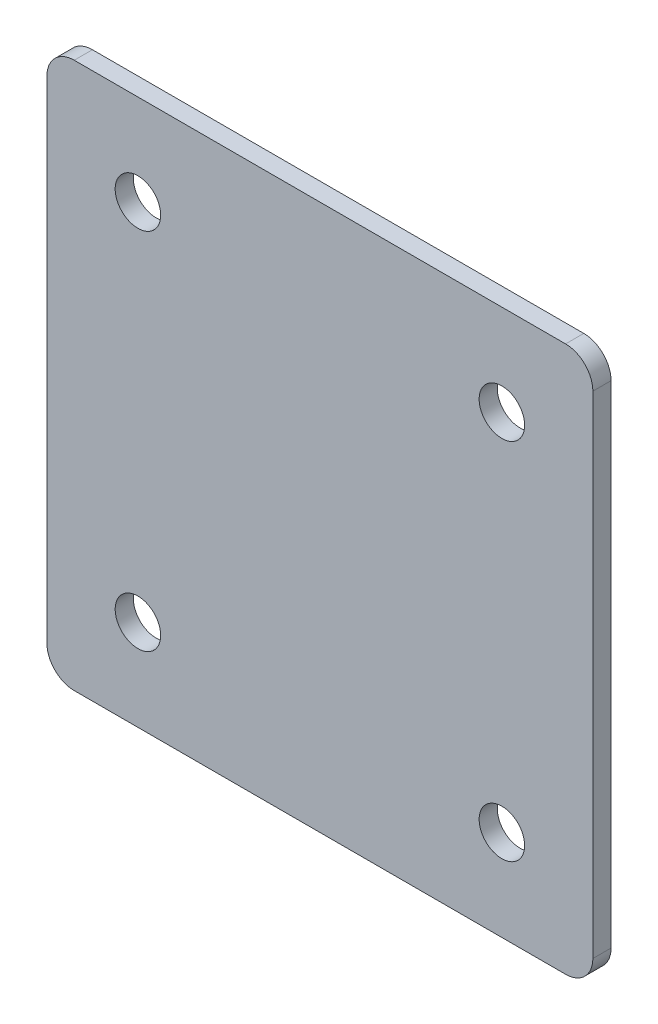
from build123d import *

# Parameters (mm, degrees)
ESQUISSE1_W      = 120
ESQUISSE1_H      = 120
EXTRUSION1_DEPTH = 4
CONG_1_R         = 6
ESQUISSE2_R      = 5
EXTRUSION2_DEPTH = 85.947042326


with BuildPart() as part:
    # Esquisse1 → Extrusion1 (new body)
    with BuildSketch(Plane.XY):
        Rectangle(ESQUISSE1_W, ESQUISSE1_H)
    extrude(amount=EXTRUSION1_DEPTH)

    # Cong_1
    cong_1_edges = [part.edges().sort_by_distance(p)[0] for p in [
        (60, -60, 2),
        (-60, -60, 2),
        (-60, 60, 2),
        (60, 60, 2),
    ]]
    fillet(cong_1_edges, radius=CONG_1_R)

    # Esquisse2 → Extrusion2 (cut, through all)
    with BuildSketch(Plane.XY.offset(4)):
        with Locations((-40, 40)):
            Circle(ESQUISSE2_R)
        with Locations((40, 40)):
            Circle(ESQUISSE2_R)
        with Locations((-40, -40)):
            Circle(ESQUISSE2_R)
        with Locations((40, -40)):
            Circle(ESQUISSE2_R)
    extrude(amount=-EXTRUSION2_DEPTH, mode=Mode.SUBTRACT)


solid = part.part
